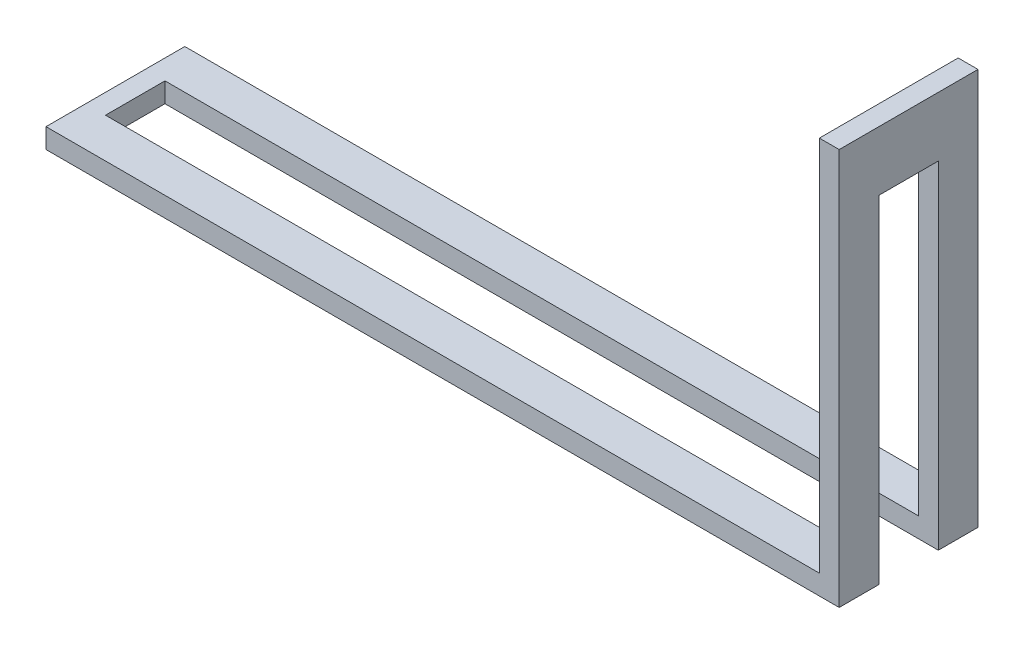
ISO-10303-21;
HEADER;
FILE_DESCRIPTION(('STEP AP214'),'2;1');
FILE_NAME('part.step','',(''),(''),'','','');
FILE_SCHEMA(('AUTOMOTIVE_DESIGN { 1 0 10303 214 1 1 1 1 }'));
ENDSEC;
DATA;
#1=APPLICATION_CONTEXT('core data for automotive mechanical design processes');
#2=APPLICATION_PROTOCOL_DEFINITION('international standard','automotive_design',2000,#1);
#3=PRODUCT_CONTEXT('',#1,'mechanical');
#4=PRODUCT('Part','Part','',(#3));
#5=PRODUCT_RELATED_PRODUCT_CATEGORY('part','',(#4));
#6=PRODUCT_DEFINITION_FORMATION('','',#4);
#7=PRODUCT_DEFINITION_CONTEXT('part definition',#1,'design');
#8=PRODUCT_DEFINITION('design','',#6,#7);
#9=PRODUCT_DEFINITION_SHAPE('','',#8);
#10=(LENGTH_UNIT() NAMED_UNIT(*) SI_UNIT(.MILLI.,.METRE.));
#11=(NAMED_UNIT(*) PLANE_ANGLE_UNIT() SI_UNIT($,.RADIAN.));
#12=(NAMED_UNIT(*) SI_UNIT($,.STERADIAN.) SOLID_ANGLE_UNIT());
#13=UNCERTAINTY_MEASURE_WITH_UNIT(LENGTH_MEASURE(1.E-05),#10,'distance_accuracy_value','');
#14=(GEOMETRIC_REPRESENTATION_CONTEXT(3) GLOBAL_UNCERTAINTY_ASSIGNED_CONTEXT((#13)) GLOBAL_UNIT_ASSIGNED_CONTEXT((#10,
#11,#12)) REPRESENTATION_CONTEXT('',''));
#15=CARTESIAN_POINT('',(0.,0.,0.));
#16=DIRECTION('',(0.,0.,1.));
#17=DIRECTION('',(1.,0.,0.));
#18=AXIS2_PLACEMENT_3D('',#15,#16,#17);
#19=CARTESIAN_POINT('',(0.,1.99999999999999,14.));
#20=DIRECTION('',(1.,0.,0.));
#21=DIRECTION('',(0.,1.,0.));
#22=AXIS2_PLACEMENT_3D('',#19,#20,#21);
#23=PLANE('',#22);
#24=DIRECTION('',(0.,-1.,0.));
#25=VECTOR('',#24,1.);
#26=CARTESIAN_POINT('',(0.,1.99999999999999,0.));
#27=LINE('',#26,#25);
#28=CARTESIAN_POINT('',(0.,1.99999999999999,0.));
#29=VERTEX_POINT('',#28);
#30=CARTESIAN_POINT('',(0.,0.,0.));
#31=VERTEX_POINT('',#30);
#32=EDGE_CURVE('E152',#29,#31,#27,.T.);
#33=ORIENTED_EDGE('',*,*,#32,.T.);
#34=DIRECTION('',(0.,0.,-1.));
#35=VECTOR('',#34,1.);
#36=CARTESIAN_POINT('',(0.,0.,14.));
#37=LINE('',#36,#35);
#38=CARTESIAN_POINT('',(0.,0.,14.));
#39=VERTEX_POINT('',#38);
#40=EDGE_CURVE('E195',#39,#31,#37,.T.);
#41=ORIENTED_EDGE('',*,*,#40,.F.);
#42=DIRECTION('',(0.,-1.,0.));
#43=VECTOR('',#42,1.);
#44=CARTESIAN_POINT('',(0.,1.99999999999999,14.));
#45=LINE('',#44,#43);
#46=CARTESIAN_POINT('',(0.,1.99999999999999,14.));
#47=VERTEX_POINT('',#46);
#48=EDGE_CURVE('E153',#47,#39,#45,.T.);
#49=ORIENTED_EDGE('',*,*,#48,.F.);
#50=DIRECTION('',(0.,0.,-1.));
#51=VECTOR('',#50,1.);
#52=CARTESIAN_POINT('',(0.,1.99999999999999,14.));
#53=LINE('',#52,#51);
#54=EDGE_CURVE('E167',#47,#29,#53,.T.);
#55=ORIENTED_EDGE('',*,*,#54,.T.);
#56=EDGE_LOOP('',(#33,#41,#49,#55));
#57=FACE_BOUND('',#56,.T.);
#58=ADVANCED_FACE('F33',(#57),#23,.F.);
#59=CARTESIAN_POINT('',(0.,0.,14.));
#60=DIRECTION('',(0.,1.,0.));
#61=DIRECTION('',(0.,0.,1.));
#62=AXIS2_PLACEMENT_3D('',#59,#60,#61);
#63=PLANE('',#62);
#64=DIRECTION('',(0.,0.,-1.));
#65=VECTOR('',#64,1.);
#66=CARTESIAN_POINT('',(80.,0.,14.));
#67=LINE('',#66,#65);
#68=CARTESIAN_POINT('',(80.,0.,4.));
#69=VERTEX_POINT('',#68);
#70=CARTESIAN_POINT('',(80.,0.,0.));
#71=VERTEX_POINT('',#70);
#72=EDGE_CURVE('E193',#69,#71,#67,.T.);
#73=ORIENTED_EDGE('',*,*,#72,.F.);
#74=DIRECTION('',(1.,0.,0.));
#75=VECTOR('',#74,1.);
#76=CARTESIAN_POINT('',(80.,0.,4.));
#77=LINE('',#76,#75);
#78=CARTESIAN_POINT('',(2.00000000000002,0.,3.99999999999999));
#79=VERTEX_POINT('',#78);
#80=EDGE_CURVE('E135',#79,#69,#77,.T.);
#81=ORIENTED_EDGE('',*,*,#80,.F.);
#82=DIRECTION('',(0.,0.,-1.));
#83=VECTOR('',#82,1.);
#84=CARTESIAN_POINT('',(2.00000000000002,0.,9.99999999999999));
#85=LINE('',#84,#83);
#86=CARTESIAN_POINT('',(2.00000000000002,0.,9.99999999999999));
#87=VERTEX_POINT('',#86);
#88=EDGE_CURVE('E335',#87,#79,#85,.T.);
#89=ORIENTED_EDGE('',*,*,#88,.F.);
#90=DIRECTION('',(-1.,0.,0.));
#91=VECTOR('',#90,1.);
#92=CARTESIAN_POINT('',(80.,0.,10.));
#93=LINE('',#92,#91);
#94=CARTESIAN_POINT('',(80.,0.,10.));
#95=VERTEX_POINT('',#94);
#96=EDGE_CURVE('E333',#95,#87,#93,.T.);
#97=ORIENTED_EDGE('',*,*,#96,.F.);
#98=CARTESIAN_POINT('',(80.,0.,14.));
#99=VERTEX_POINT('',#98);
#100=EDGE_CURVE('E141',#99,#95,#67,.T.);
#101=ORIENTED_EDGE('',*,*,#100,.F.);
#102=DIRECTION('',(1.,0.,0.));
#103=VECTOR('',#102,1.);
#104=CARTESIAN_POINT('',(0.,0.,14.));
#105=LINE('',#104,#103);
#106=EDGE_CURVE('E156',#39,#99,#105,.T.);
#107=ORIENTED_EDGE('',*,*,#106,.F.);
#108=ORIENTED_EDGE('',*,*,#40,.T.);
#109=DIRECTION('',(1.,0.,0.));
#110=VECTOR('',#109,1.);
#111=CARTESIAN_POINT('',(0.,0.,0.));
#112=LINE('',#111,#110);
#113=EDGE_CURVE('E170',#31,#71,#112,.T.);
#114=ORIENTED_EDGE('',*,*,#113,.T.);
#115=EDGE_LOOP('',(#73,#81,#89,#97,#101,#107,#108,#114));
#116=FACE_BOUND('',#115,.T.);
#117=ADVANCED_FACE('F238',(#116),#63,.F.);
#118=CARTESIAN_POINT('',(80.,0.,14.));
#119=DIRECTION('',(-1.,0.,0.));
#120=DIRECTION('',(0.,-1.,0.));
#121=AXIS2_PLACEMENT_3D('',#118,#119,#120);
#122=PLANE('',#121);
#123=DIRECTION('',(0.,0.,1.));
#124=VECTOR('',#123,1.);
#125=CARTESIAN_POINT('',(80.,34.,10.));
#126=LINE('',#125,#124);
#127=CARTESIAN_POINT('',(80.,34.,3.99999999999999));
#128=VERTEX_POINT('',#127);
#129=CARTESIAN_POINT('',(80.,34.,10.));
#130=VERTEX_POINT('',#129);
#131=EDGE_CURVE('E130',#128,#130,#126,.T.);
#132=ORIENTED_EDGE('',*,*,#131,.F.);
#133=DIRECTION('',(0.,-1.,0.));
#134=VECTOR('',#133,1.);
#135=CARTESIAN_POINT('',(80.,34.,4.));
#136=LINE('',#135,#134);
#137=EDGE_CURVE('E47',#128,#69,#136,.T.);
#138=ORIENTED_EDGE('',*,*,#137,.T.);
#139=ORIENTED_EDGE('',*,*,#72,.T.);
#140=DIRECTION('',(0.,1.,0.));
#141=VECTOR('',#140,1.);
#142=CARTESIAN_POINT('',(80.,0.,0.));
#143=LINE('',#142,#141);
#144=CARTESIAN_POINT('',(80.,40.,0.));
#145=VERTEX_POINT('',#144);
#146=EDGE_CURVE('E173',#71,#145,#143,.T.);
#147=ORIENTED_EDGE('',*,*,#146,.T.);
#148=DIRECTION('',(0.,0.,-1.));
#149=VECTOR('',#148,1.);
#150=CARTESIAN_POINT('',(80.,40.,14.));
#151=LINE('',#150,#149);
#152=CARTESIAN_POINT('',(80.,40.,14.));
#153=VERTEX_POINT('',#152);
#154=EDGE_CURVE('E190',#153,#145,#151,.T.);
#155=ORIENTED_EDGE('',*,*,#154,.F.);
#156=DIRECTION('',(0.,1.,0.));
#157=VECTOR('',#156,1.);
#158=CARTESIAN_POINT('',(80.,0.,14.));
#159=LINE('',#158,#157);
#160=EDGE_CURVE('E159',#99,#153,#159,.T.);
#161=ORIENTED_EDGE('',*,*,#160,.F.);
#162=ORIENTED_EDGE('',*,*,#100,.T.);
#163=DIRECTION('',(0.,-1.,0.));
#164=VECTOR('',#163,1.);
#165=CARTESIAN_POINT('',(80.,34.,10.));
#166=LINE('',#165,#164);
#167=EDGE_CURVE('E124',#130,#95,#166,.T.);
#168=ORIENTED_EDGE('',*,*,#167,.F.);
#169=EDGE_LOOP('',(#132,#138,#139,#147,#155,#161,#162,#168));
#170=FACE_BOUND('',#169,.T.);
#171=ADVANCED_FACE('F138',(#170),#122,.F.);
#172=CARTESIAN_POINT('',(80.,40.,14.));
#173=DIRECTION('',(0.,-1.,0.));
#174=DIRECTION('',(0.,0.,-1.));
#175=AXIS2_PLACEMENT_3D('',#172,#173,#174);
#176=PLANE('',#175);
#177=DIRECTION('',(-1.,0.,0.));
#178=VECTOR('',#177,1.);
#179=CARTESIAN_POINT('',(80.,40.,0.));
#180=LINE('',#179,#178);
#181=CARTESIAN_POINT('',(78.,40.,0.));
#182=VERTEX_POINT('',#181);
#183=EDGE_CURVE('E175',#145,#182,#180,.T.);
#184=ORIENTED_EDGE('',*,*,#183,.T.);
#185=DIRECTION('',(0.,0.,-1.));
#186=VECTOR('',#185,1.);
#187=CARTESIAN_POINT('',(78.,40.,14.));
#188=LINE('',#187,#186);
#189=CARTESIAN_POINT('',(78.,40.,14.));
#190=VERTEX_POINT('',#189);
#191=EDGE_CURVE('E187',#190,#182,#188,.T.);
#192=ORIENTED_EDGE('',*,*,#191,.F.);
#193=DIRECTION('',(-1.,0.,0.));
#194=VECTOR('',#193,1.);
#195=CARTESIAN_POINT('',(80.,40.,14.));
#196=LINE('',#195,#194);
#197=EDGE_CURVE('E161',#153,#190,#196,.T.);
#198=ORIENTED_EDGE('',*,*,#197,.F.);
#199=ORIENTED_EDGE('',*,*,#154,.T.);
#200=EDGE_LOOP('',(#184,#192,#198,#199));
#201=FACE_BOUND('',#200,.T.);
#202=ADVANCED_FACE('F246',(#201),#176,.F.);
#203=CARTESIAN_POINT('',(78.,40.,14.));
#204=DIRECTION('',(1.,0.,0.));
#205=DIRECTION('',(0.,0.,-1.));
#206=AXIS2_PLACEMENT_3D('',#203,#204,#205);
#207=PLANE('',#206);
#208=DIRECTION('',(0.,0.,-1.));
#209=VECTOR('',#208,1.);
#210=CARTESIAN_POINT('',(78.,2.,14.));
#211=LINE('',#210,#209);
#212=CARTESIAN_POINT('',(78.,2.,4.));
#213=VERTEX_POINT('',#212);
#214=CARTESIAN_POINT('',(78.,2.,0.));
#215=VERTEX_POINT('',#214);
#216=EDGE_CURVE('E183',#213,#215,#211,.T.);
#217=ORIENTED_EDGE('',*,*,#216,.F.);
#218=DIRECTION('',(0.,1.,0.));
#219=VECTOR('',#218,1.);
#220=CARTESIAN_POINT('',(78.,40.,4.));
#221=LINE('',#220,#219);
#222=CARTESIAN_POINT('',(78.,34.,4.));
#223=VERTEX_POINT('',#222);
#224=EDGE_CURVE('E149',#213,#223,#221,.T.);
#225=ORIENTED_EDGE('',*,*,#224,.T.);
#226=DIRECTION('',(0.,0.,1.));
#227=VECTOR('',#226,1.);
#228=CARTESIAN_POINT('',(78.,34.,14.));
#229=LINE('',#228,#227);
#230=CARTESIAN_POINT('',(78.,34.,10.));
#231=VERTEX_POINT('',#230);
#232=EDGE_CURVE('E11',#223,#231,#229,.T.);
#233=ORIENTED_EDGE('',*,*,#232,.T.);
#234=DIRECTION('',(0.,-1.,0.));
#235=VECTOR('',#234,1.);
#236=CARTESIAN_POINT('',(78.,40.,10.));
#237=LINE('',#236,#235);
#238=CARTESIAN_POINT('',(78.,2.,10.));
#239=VERTEX_POINT('',#238);
#240=EDGE_CURVE('E127',#231,#239,#237,.T.);
#241=ORIENTED_EDGE('',*,*,#240,.T.);
#242=CARTESIAN_POINT('',(78.,2.,14.));
#243=VERTEX_POINT('',#242);
#244=EDGE_CURVE('E184',#243,#239,#211,.T.);
#245=ORIENTED_EDGE('',*,*,#244,.F.);
#246=DIRECTION('',(0.,-1.,0.));
#247=VECTOR('',#246,1.);
#248=CARTESIAN_POINT('',(78.,40.,14.));
#249=LINE('',#248,#247);
#250=EDGE_CURVE('E163',#190,#243,#249,.T.);
#251=ORIENTED_EDGE('',*,*,#250,.F.);
#252=ORIENTED_EDGE('',*,*,#191,.T.);
#253=DIRECTION('',(0.,-1.,0.));
#254=VECTOR('',#253,1.);
#255=CARTESIAN_POINT('',(78.,40.,0.));
#256=LINE('',#255,#254);
#257=EDGE_CURVE('E177',#182,#215,#256,.T.);
#258=ORIENTED_EDGE('',*,*,#257,.T.);
#259=EDGE_LOOP('',(#217,#225,#233,#241,#245,#251,#252,#258));
#260=FACE_BOUND('',#259,.T.);
#261=ADVANCED_FACE('F209',(#260),#207,.F.);
#262=CARTESIAN_POINT('',(78.,2.,14.));
#263=DIRECTION('',(0.,-1.,0.));
#264=DIRECTION('',(1.,0.,0.));
#265=AXIS2_PLACEMENT_3D('',#262,#263,#264);
#266=PLANE('',#265);
#267=DIRECTION('',(0.,0.,-1.));
#268=VECTOR('',#267,1.);
#269=CARTESIAN_POINT('',(2.00000000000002,1.99999999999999,14.));
#270=LINE('',#269,#268);
#271=CARTESIAN_POINT('',(2.00000000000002,1.99999999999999,9.99999999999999));
#272=VERTEX_POINT('',#271);
#273=CARTESIAN_POINT('',(2.00000000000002,1.99999999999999,3.99999999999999));
#274=VERTEX_POINT('',#273);
#275=EDGE_CURVE('E201',#272,#274,#270,.T.);
#276=ORIENTED_EDGE('',*,*,#275,.T.);
#277=DIRECTION('',(1.,0.,0.));
#278=VECTOR('',#277,1.);
#279=CARTESIAN_POINT('',(78.,2.,4.));
#280=LINE('',#279,#278);
#281=EDGE_CURVE('E40',#274,#213,#280,.T.);
#282=ORIENTED_EDGE('',*,*,#281,.T.);
#283=ORIENTED_EDGE('',*,*,#216,.T.);
#284=DIRECTION('',(-1.,0.,0.));
#285=VECTOR('',#284,1.);
#286=CARTESIAN_POINT('',(78.,2.,0.));
#287=LINE('',#286,#285);
#288=EDGE_CURVE('E157',#215,#29,#287,.T.);
#289=ORIENTED_EDGE('',*,*,#288,.T.);
#290=ORIENTED_EDGE('',*,*,#54,.F.);
#291=DIRECTION('',(-1.,0.,0.));
#292=VECTOR('',#291,1.);
#293=CARTESIAN_POINT('',(78.,2.,14.));
#294=LINE('',#293,#292);
#295=EDGE_CURVE('E165',#243,#47,#294,.T.);
#296=ORIENTED_EDGE('',*,*,#295,.F.);
#297=ORIENTED_EDGE('',*,*,#244,.T.);
#298=DIRECTION('',(-1.,0.,0.));
#299=VECTOR('',#298,1.);
#300=CARTESIAN_POINT('',(78.,2.,10.));
#301=LINE('',#300,#299);
#302=EDGE_CURVE('E198',#239,#272,#301,.T.);
#303=ORIENTED_EDGE('',*,*,#302,.T.);
#304=EDGE_LOOP('',(#276,#282,#283,#289,#290,#296,#297,#303));
#305=FACE_BOUND('',#304,.T.);
#306=ADVANCED_FACE('F206',(#305),#266,.F.);
#307=CARTESIAN_POINT('',(0.,0.,14.));
#308=DIRECTION('',(0.,0.,1.));
#309=DIRECTION('',(1.,0.,0.));
#310=AXIS2_PLACEMENT_3D('',#307,#308,#309);
#311=PLANE('',#310);
#312=ORIENTED_EDGE('',*,*,#48,.T.);
#313=ORIENTED_EDGE('',*,*,#106,.T.);
#314=ORIENTED_EDGE('',*,*,#160,.T.);
#315=ORIENTED_EDGE('',*,*,#197,.T.);
#316=ORIENTED_EDGE('',*,*,#250,.T.);
#317=ORIENTED_EDGE('',*,*,#295,.T.);
#318=EDGE_LOOP('',(#312,#313,#314,#315,#316,#317));
#319=FACE_BOUND('',#318,.T.);
#320=ADVANCED_FACE('F224',(#319),#311,.T.);
#321=CARTESIAN_POINT('',(0.,0.,0.));
#322=DIRECTION('',(0.,0.,1.));
#323=DIRECTION('',(1.,0.,0.));
#324=AXIS2_PLACEMENT_3D('',#321,#322,#323);
#325=PLANE('',#324);
#326=ORIENTED_EDGE('',*,*,#32,.F.);
#327=ORIENTED_EDGE('',*,*,#288,.F.);
#328=ORIENTED_EDGE('',*,*,#257,.F.);
#329=ORIENTED_EDGE('',*,*,#183,.F.);
#330=ORIENTED_EDGE('',*,*,#146,.F.);
#331=ORIENTED_EDGE('',*,*,#113,.F.);
#332=EDGE_LOOP('',(#326,#327,#328,#329,#330,#331));
#333=FACE_BOUND('',#332,.T.);
#334=ADVANCED_FACE('F217',(#333),#325,.F.);
#335=CARTESIAN_POINT('',(0.,34.,0.));
#336=DIRECTION('',(0.,1.,0.));
#337=DIRECTION('',(0.,0.,1.));
#338=AXIS2_PLACEMENT_3D('',#335,#336,#337);
#339=PLANE('',#338);
#340=DIRECTION('',(1.,0.,0.));
#341=VECTOR('',#340,1.);
#342=CARTESIAN_POINT('',(80.,34.,4.));
#343=LINE('',#342,#341);
#344=EDGE_CURVE('E129',#223,#128,#343,.T.);
#345=ORIENTED_EDGE('',*,*,#344,.T.);
#346=ORIENTED_EDGE('',*,*,#131,.T.);
#347=DIRECTION('',(-1.,0.,0.));
#348=VECTOR('',#347,1.);
#349=CARTESIAN_POINT('',(80.,34.,10.));
#350=LINE('',#349,#348);
#351=EDGE_CURVE('E120',#130,#231,#350,.T.);
#352=ORIENTED_EDGE('',*,*,#351,.T.);
#353=ORIENTED_EDGE('',*,*,#232,.F.);
#354=EDGE_LOOP('',(#345,#346,#352,#353));
#355=FACE_BOUND('',#354,.T.);
#356=ADVANCED_FACE('F133',(#355),#339,.F.);
#357=CARTESIAN_POINT('',(80.,34.,4.));
#358=DIRECTION('',(0.,0.,-1.));
#359=DIRECTION('',(-1.,0.,0.));
#360=AXIS2_PLACEMENT_3D('',#357,#358,#359);
#361=PLANE('',#360);
#362=ORIENTED_EDGE('',*,*,#281,.F.);
#363=DIRECTION('',(0.,-1.,0.));
#364=VECTOR('',#363,1.);
#365=CARTESIAN_POINT('',(2.00000000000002,34.,3.99999999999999));
#366=LINE('',#365,#364);
#367=EDGE_CURVE('E143',#274,#79,#366,.T.);
#368=ORIENTED_EDGE('',*,*,#367,.T.);
#369=ORIENTED_EDGE('',*,*,#80,.T.);
#370=ORIENTED_EDGE('',*,*,#137,.F.);
#371=ORIENTED_EDGE('',*,*,#344,.F.);
#372=ORIENTED_EDGE('',*,*,#224,.F.);
#373=EDGE_LOOP('',(#362,#368,#369,#370,#371,#372));
#374=FACE_BOUND('',#373,.T.);
#375=ADVANCED_FACE('F226',(#374),#361,.F.);
#376=CARTESIAN_POINT('',(2.00000000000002,34.,9.99999999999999));
#377=DIRECTION('',(-1.,0.,0.));
#378=DIRECTION('',(0.,0.,1.));
#379=AXIS2_PLACEMENT_3D('',#376,#377,#378);
#380=PLANE('',#379);
#381=DIRECTION('',(0.,-1.,0.));
#382=VECTOR('',#381,1.);
#383=CARTESIAN_POINT('',(2.00000000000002,34.,9.99999999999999));
#384=LINE('',#383,#382);
#385=EDGE_CURVE('E55',#272,#87,#384,.T.);
#386=ORIENTED_EDGE('',*,*,#385,.T.);
#387=ORIENTED_EDGE('',*,*,#88,.T.);
#388=ORIENTED_EDGE('',*,*,#367,.F.);
#389=ORIENTED_EDGE('',*,*,#275,.F.);
#390=EDGE_LOOP('',(#386,#387,#388,#389));
#391=FACE_BOUND('',#390,.T.);
#392=ADVANCED_FACE('F228',(#391),#380,.F.);
#393=CARTESIAN_POINT('',(80.,34.,10.));
#394=DIRECTION('',(0.,0.,1.));
#395=DIRECTION('',(1.,0.,0.));
#396=AXIS2_PLACEMENT_3D('',#393,#394,#395);
#397=PLANE('',#396);
#398=ORIENTED_EDGE('',*,*,#351,.F.);
#399=ORIENTED_EDGE('',*,*,#167,.T.);
#400=ORIENTED_EDGE('',*,*,#96,.T.);
#401=ORIENTED_EDGE('',*,*,#385,.F.);
#402=ORIENTED_EDGE('',*,*,#302,.F.);
#403=ORIENTED_EDGE('',*,*,#240,.F.);
#404=EDGE_LOOP('',(#398,#399,#400,#401,#402,#403));
#405=FACE_BOUND('',#404,.T.);
#406=ADVANCED_FACE('F122',(#405),#397,.F.);
#407=CLOSED_SHELL('',(#58,#117,#171,#202,#261,#306,#320,#334,#356,#375,#392,#406));
#408=MANIFOLD_SOLID_BREP('B2',#407);
#409=ADVANCED_BREP_SHAPE_REPRESENTATION('',(#18,#408),#14);
#410=SHAPE_DEFINITION_REPRESENTATION(#9,#409);
ENDSEC;
END-ISO-10303-21;
